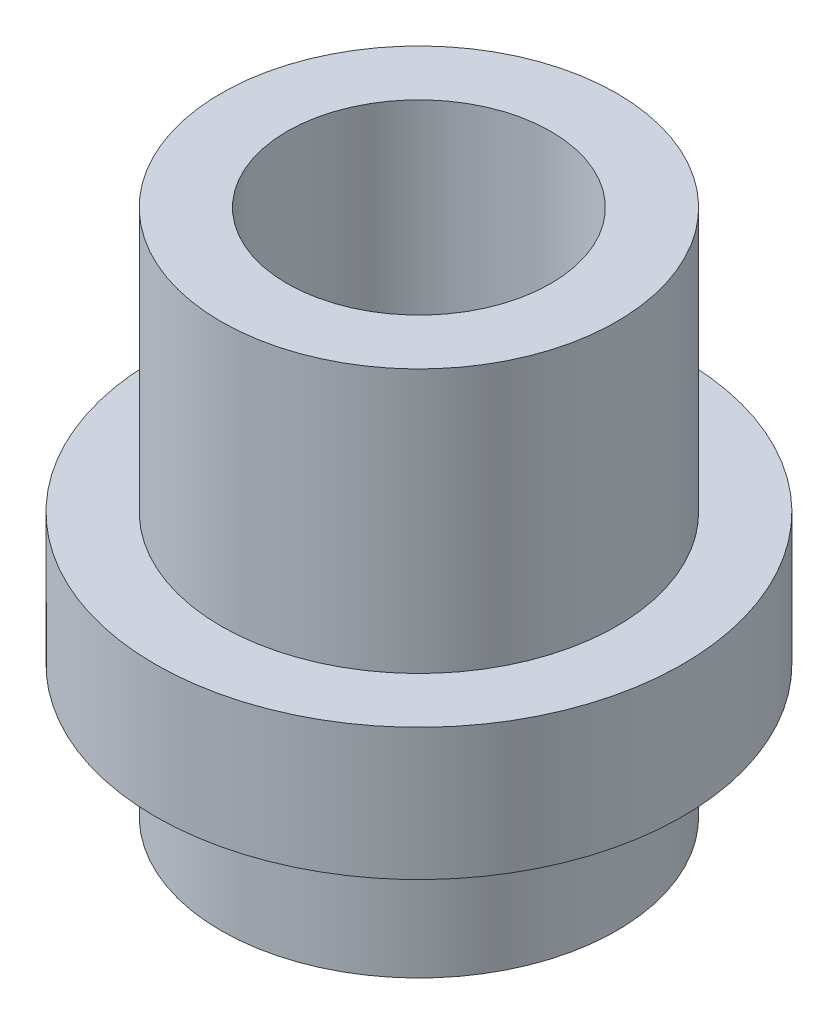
ISO-10303-21;
HEADER;
FILE_DESCRIPTION(('STEP AP214'),'2;1');
FILE_NAME('part.step','',(''),(''),'','','');
FILE_SCHEMA(('AUTOMOTIVE_DESIGN { 1 0 10303 214 1 1 1 1 }'));
ENDSEC;
DATA;
#1=APPLICATION_CONTEXT('core data for automotive mechanical design processes');
#2=APPLICATION_PROTOCOL_DEFINITION('international standard','automotive_design',2000,#1);
#3=PRODUCT_CONTEXT('',#1,'mechanical');
#4=PRODUCT('Part','Part','',(#3));
#5=PRODUCT_RELATED_PRODUCT_CATEGORY('part','',(#4));
#6=PRODUCT_DEFINITION_FORMATION('','',#4);
#7=PRODUCT_DEFINITION_CONTEXT('part definition',#1,'design');
#8=PRODUCT_DEFINITION('design','',#6,#7);
#9=PRODUCT_DEFINITION_SHAPE('','',#8);
#10=(LENGTH_UNIT() NAMED_UNIT(*) SI_UNIT(.MILLI.,.METRE.));
#11=(NAMED_UNIT(*) PLANE_ANGLE_UNIT() SI_UNIT($,.RADIAN.));
#12=(NAMED_UNIT(*) SI_UNIT($,.STERADIAN.) SOLID_ANGLE_UNIT());
#13=UNCERTAINTY_MEASURE_WITH_UNIT(LENGTH_MEASURE(1.E-05),#10,'distance_accuracy_value','');
#14=(GEOMETRIC_REPRESENTATION_CONTEXT(3) GLOBAL_UNCERTAINTY_ASSIGNED_CONTEXT((#13)) GLOBAL_UNIT_ASSIGNED_CONTEXT((#10,
#11,#12)) REPRESENTATION_CONTEXT('',''));
#15=CARTESIAN_POINT('',(0.,0.,0.));
#16=DIRECTION('',(0.,0.,1.));
#17=DIRECTION('',(1.,0.,0.));
#18=AXIS2_PLACEMENT_3D('',#15,#16,#17);
#19=CARTESIAN_POINT('',(0.,10.,0.));
#20=DIRECTION('',(0.,1.,0.));
#21=DIRECTION('',(0.,0.,1.));
#22=AXIS2_PLACEMENT_3D('',#19,#20,#21);
#23=PLANE('',#22);
#24=CARTESIAN_POINT('',(0.,10.,0.));
#25=DIRECTION('',(0.,1.,0.));
#26=DIRECTION('',(0.,0.,1.));
#27=AXIS2_PLACEMENT_3D('',#24,#25,#26);
#28=CIRCLE('',#27,5.);
#29=CARTESIAN_POINT('',(0.,10.,5.));
#30=VERTEX_POINT('',#29);
#31=EDGE_CURVE('E57',#30,#30,#28,.T.);
#32=ORIENTED_EDGE('',*,*,#31,.F.);
#33=EDGE_LOOP('',(#32));
#34=FACE_BOUND('',#33,.T.);
#35=CARTESIAN_POINT('',(0.,10.,0.));
#36=DIRECTION('',(0.,1.,0.));
#37=DIRECTION('',(0.,0.,1.));
#38=AXIS2_PLACEMENT_3D('',#35,#36,#37);
#39=CIRCLE('',#38,7.5);
#40=CARTESIAN_POINT('',(0.,10.,7.5));
#41=VERTEX_POINT('',#40);
#42=EDGE_CURVE('E10',#41,#41,#39,.T.);
#43=ORIENTED_EDGE('',*,*,#42,.T.);
#44=EDGE_LOOP('',(#43));
#45=FACE_BOUND('',#44,.T.);
#46=ADVANCED_FACE('F31',(#34,#45),#23,.T.);
#47=CARTESIAN_POINT('',(0.,11.0837438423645,0.));
#48=DIRECTION('',(0.,1.,0.));
#49=DIRECTION('',(0.,0.,1.));
#50=AXIS2_PLACEMENT_3D('',#47,#48,#49);
#51=CYLINDRICAL_SURFACE('',#50,7.5);
#52=CARTESIAN_POINT('',(0.,0.,0.));
#53=DIRECTION('',(0.,1.,0.));
#54=DIRECTION('',(0.,0.,1.));
#55=AXIS2_PLACEMENT_3D('',#52,#53,#54);
#56=CIRCLE('',#55,7.5);
#57=CARTESIAN_POINT('',(0.,0.,7.5));
#58=VERTEX_POINT('',#57);
#59=EDGE_CURVE('E37',#58,#58,#56,.T.);
#60=ORIENTED_EDGE('',*,*,#59,.T.);
#61=EDGE_LOOP('',(#60));
#62=FACE_BOUND('',#61,.T.);
#63=ORIENTED_EDGE('',*,*,#42,.F.);
#64=EDGE_LOOP('',(#63));
#65=FACE_BOUND('',#64,.T.);
#66=ADVANCED_FACE('F73',(#62,#65),#51,.T.);
#67=CARTESIAN_POINT('',(-7.5,0.,0.));
#68=DIRECTION('',(0.,1.,0.));
#69=DIRECTION('',(0.,0.,1.));
#70=AXIS2_PLACEMENT_3D('',#67,#68,#69);
#71=PLANE('',#70);
#72=CARTESIAN_POINT('',(0.,0.,0.));
#73=DIRECTION('',(0.,1.,0.));
#74=DIRECTION('',(0.,0.,1.));
#75=AXIS2_PLACEMENT_3D('',#72,#73,#74);
#76=CIRCLE('',#75,10.);
#77=CARTESIAN_POINT('',(0.,0.,10.));
#78=VERTEX_POINT('',#77);
#79=EDGE_CURVE('E41',#78,#78,#76,.T.);
#80=ORIENTED_EDGE('',*,*,#79,.T.);
#81=EDGE_LOOP('',(#80));
#82=FACE_BOUND('',#81,.T.);
#83=ORIENTED_EDGE('',*,*,#59,.F.);
#84=EDGE_LOOP('',(#83));
#85=FACE_BOUND('',#84,.T.);
#86=ADVANCED_FACE('F77',(#82,#85),#71,.T.);
#87=CARTESIAN_POINT('',(0.,11.0837438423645,0.));
#88=DIRECTION('',(0.,1.,0.));
#89=DIRECTION('',(0.,0.,1.));
#90=AXIS2_PLACEMENT_3D('',#87,#88,#89);
#91=CYLINDRICAL_SURFACE('',#90,10.);
#92=CARTESIAN_POINT('',(0.,-5.,0.));
#93=DIRECTION('',(0.,1.,0.));
#94=DIRECTION('',(0.,0.,1.));
#95=AXIS2_PLACEMENT_3D('',#92,#93,#94);
#96=CIRCLE('',#95,10.);
#97=CARTESIAN_POINT('',(0.,-5.,10.));
#98=VERTEX_POINT('',#97);
#99=EDGE_CURVE('E45',#98,#98,#96,.T.);
#100=ORIENTED_EDGE('',*,*,#99,.T.);
#101=EDGE_LOOP('',(#100));
#102=FACE_BOUND('',#101,.T.);
#103=ORIENTED_EDGE('',*,*,#79,.F.);
#104=EDGE_LOOP('',(#103));
#105=FACE_BOUND('',#104,.T.);
#106=ADVANCED_FACE('F81',(#102,#105),#91,.T.);
#107=CARTESIAN_POINT('',(-10.,-5.,0.));
#108=DIRECTION('',(0.,-1.,0.));
#109=DIRECTION('',(0.,0.,-1.));
#110=AXIS2_PLACEMENT_3D('',#107,#108,#109);
#111=PLANE('',#110);
#112=CARTESIAN_POINT('',(0.,-5.,0.));
#113=DIRECTION('',(0.,1.,0.));
#114=DIRECTION('',(0.,0.,1.));
#115=AXIS2_PLACEMENT_3D('',#112,#113,#114);
#116=CIRCLE('',#115,7.5);
#117=CARTESIAN_POINT('',(0.,-5.,7.5));
#118=VERTEX_POINT('',#117);
#119=EDGE_CURVE('E50',#118,#118,#116,.T.);
#120=ORIENTED_EDGE('',*,*,#119,.T.);
#121=EDGE_LOOP('',(#120));
#122=FACE_BOUND('',#121,.T.);
#123=ORIENTED_EDGE('',*,*,#99,.F.);
#124=EDGE_LOOP('',(#123));
#125=FACE_BOUND('',#124,.T.);
#126=ADVANCED_FACE('F88',(#122,#125),#111,.T.);
#127=CARTESIAN_POINT('',(0.,11.0837438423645,0.));
#128=DIRECTION('',(0.,1.,0.));
#129=DIRECTION('',(0.,0.,1.));
#130=AXIS2_PLACEMENT_3D('',#127,#128,#129);
#131=CYLINDRICAL_SURFACE('',#130,7.5);
#132=CARTESIAN_POINT('',(0.,-10.,0.));
#133=DIRECTION('',(0.,1.,0.));
#134=DIRECTION('',(0.,0.,1.));
#135=AXIS2_PLACEMENT_3D('',#132,#133,#134);
#136=CIRCLE('',#135,7.5);
#137=CARTESIAN_POINT('',(0.,-10.,7.5));
#138=VERTEX_POINT('',#137);
#139=EDGE_CURVE('E53',#138,#138,#136,.T.);
#140=ORIENTED_EDGE('',*,*,#139,.T.);
#141=EDGE_LOOP('',(#140));
#142=FACE_BOUND('',#141,.T.);
#143=ORIENTED_EDGE('',*,*,#119,.F.);
#144=EDGE_LOOP('',(#143));
#145=FACE_BOUND('',#144,.T.);
#146=ADVANCED_FACE('F92',(#142,#145),#131,.T.);
#147=CARTESIAN_POINT('',(-7.5,-10.,0.));
#148=DIRECTION('',(0.,-1.,0.));
#149=DIRECTION('',(0.,0.,-1.));
#150=AXIS2_PLACEMENT_3D('',#147,#148,#149);
#151=PLANE('',#150);
#152=CARTESIAN_POINT('',(0.,-10.,0.));
#153=DIRECTION('',(0.,1.,0.));
#154=DIRECTION('',(0.,0.,1.));
#155=AXIS2_PLACEMENT_3D('',#152,#153,#154);
#156=CIRCLE('',#155,5.);
#157=CARTESIAN_POINT('',(0.,-10.,5.));
#158=VERTEX_POINT('',#157);
#159=EDGE_CURVE('E56',#158,#158,#156,.T.);
#160=ORIENTED_EDGE('',*,*,#159,.T.);
#161=EDGE_LOOP('',(#160));
#162=FACE_BOUND('',#161,.T.);
#163=ORIENTED_EDGE('',*,*,#139,.F.);
#164=EDGE_LOOP('',(#163));
#165=FACE_BOUND('',#164,.T.);
#166=ADVANCED_FACE('F63',(#162,#165),#151,.T.);
#167=CARTESIAN_POINT('',(0.,-10.,0.));
#168=DIRECTION('',(0.,1.,0.));
#169=DIRECTION('',(0.,0.,1.));
#170=AXIS2_PLACEMENT_3D('',#167,#168,#169);
#171=CYLINDRICAL_SURFACE('',#170,5.);
#172=ORIENTED_EDGE('',*,*,#159,.F.);
#173=EDGE_LOOP('',(#172));
#174=FACE_BOUND('',#173,.T.);
#175=ORIENTED_EDGE('',*,*,#31,.T.);
#176=EDGE_LOOP('',(#175));
#177=FACE_BOUND('',#176,.T.);
#178=ADVANCED_FACE('F66',(#174,#177),#171,.F.);
#179=CLOSED_SHELL('',(#46,#66,#86,#106,#126,#146,#166,#178));
#180=MANIFOLD_SOLID_BREP('B2',#179);
#181=ADVANCED_BREP_SHAPE_REPRESENTATION('',(#18,#180),#14);
#182=SHAPE_DEFINITION_REPRESENTATION(#9,#181);
ENDSEC;
END-ISO-10303-21;
